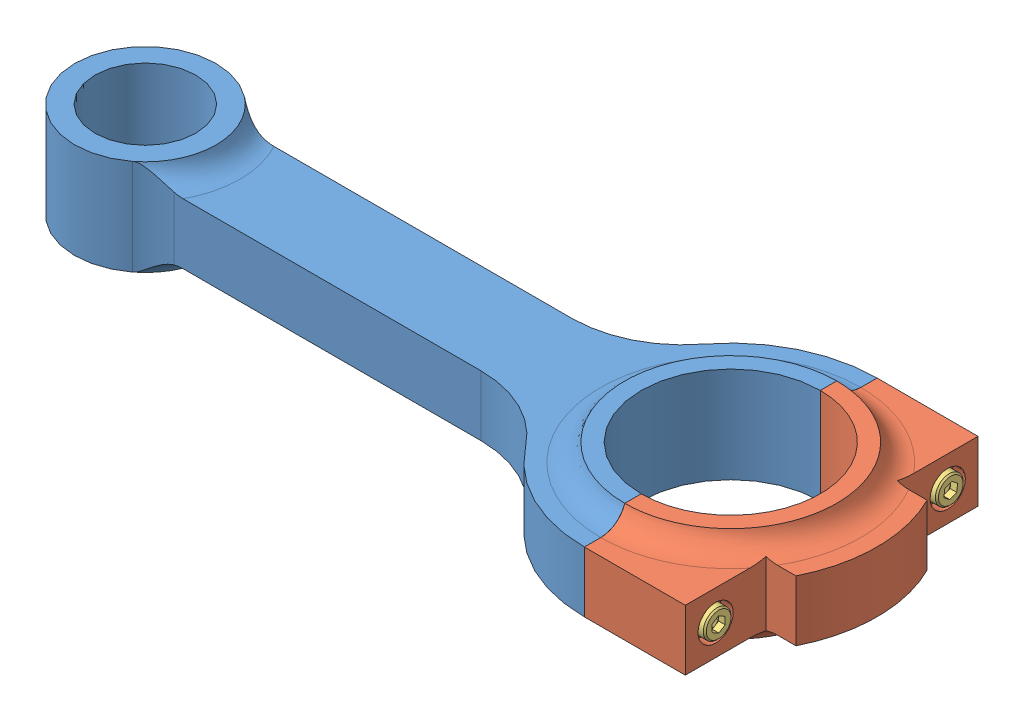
SolidWorks assembly Connecting Rod-Assembly.SLDASM, configuration Default (file format 10000). Lengths in mm.
Overall size (159 20.03 58).
4 component instances, 3 part files, 7 mates.
Components (placement in the parent):
- Connecting Rod-1-1: Connecting Rod-1.SLDPRT [Default] at origin size (130 20.03 58)
- Connecting Rod-2-1: Connecting Rod-2.SLDPRT [Default] at origin size (29 19 58)
- socket head cap screw_am-1: socket head cap screw_am.sldprt [B18.3.1M - 3 x 0.5 x 25 Hex SHCS -- 18NHX] at (20.6 0 -23) x (-1 0 0) z (0 -0.924225 -0.381849) size (28 5.5 5.5)
- socket head cap screw_am-2: socket head cap screw_am.sldprt [B18.3.1M - 3 x 0.5 x 25 Hex SHCS -- 18NHX] at (20.6 0 23) x (-1 0 0) z (0 -0.85199 -0.523557) size (28 5.5 5.5)
Mates (geometry in assembly coordinates):
- Concentric1: concentric aligned: cylinder of Connecting Rod-1-1 through (0 6 0) axis (0 -1 0) radius 17.75; cylinder of Connecting Rod-2-1 through (0 6 0) axis (0 -1 0) radius 17.75
- Coincident1: coincident anti-aligned: plane of Connecting Rod-1-1 through (0 -10.0254 -51.7071) normal (1 0 0); plane of Connecting Rod-2-1 through (0 -10.0254 -51.7071) normal (-1 0 0)
- Coincident2: coincident aligned: circle of Connecting Rod-1-1; plane of Connecting Rod-2-1 through (0 9.5 0) normal (0 1 0)
- Concentric2: concentric aligned: cylinder of Connecting Rod-2-1 through (20 0 -23) axis (1 0 0) radius 1.7; cylinder of socket head cap screw_am-1 through (52.35 0 -23) axis (1 0 0) radius 1.5
- Coincident3: coincident anti-aligned: plane of Connecting Rod-2-1 through (17.6 1.7 -23) normal (1 0 0); plane of socket head cap screw_am-1 through (17.6 1.0501 -25.5416) normal (-1 0 0)
- Concentric3: concentric aligned: cylinder of Connecting Rod-2-1 through (20 0 23) axis (1 0 0) radius 1.7; cylinder of socket head cap screw_am-2 through (52.35 0 23) axis (1 0 0) radius 1.5
- Coincident4: coincident anti-aligned: plane of Connecting Rod-2-1 through (17.6 1.7 23) normal (1 0 0); plane of socket head cap screw_am-2 through (17.6 1.4398 20.657) normal (-1 0 0)
